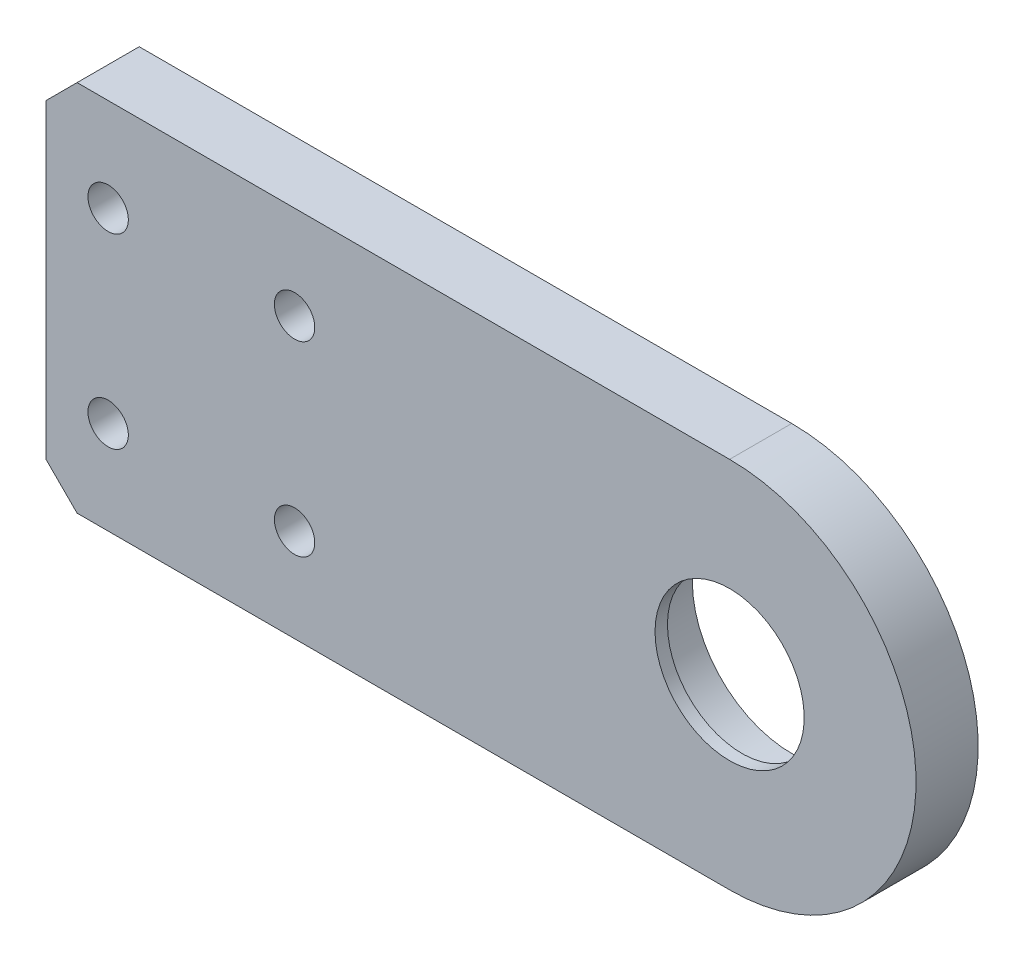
ISO-10303-21;
HEADER;
FILE_DESCRIPTION(('STEP AP214'),'2;1');
FILE_NAME('part.step','',(''),(''),'','','');
FILE_SCHEMA(('AUTOMOTIVE_DESIGN { 1 0 10303 214 1 1 1 1 }'));
ENDSEC;
DATA;
#1=APPLICATION_CONTEXT('core data for automotive mechanical design processes');
#2=APPLICATION_PROTOCOL_DEFINITION('international standard','automotive_design',2000,#1);
#3=PRODUCT_CONTEXT('',#1,'mechanical');
#4=PRODUCT('Part','Part','',(#3));
#5=PRODUCT_RELATED_PRODUCT_CATEGORY('part','',(#4));
#6=PRODUCT_DEFINITION_FORMATION('','',#4);
#7=PRODUCT_DEFINITION_CONTEXT('part definition',#1,'design');
#8=PRODUCT_DEFINITION('design','',#6,#7);
#9=PRODUCT_DEFINITION_SHAPE('','',#8);
#10=(LENGTH_UNIT() NAMED_UNIT(*) SI_UNIT(.MILLI.,.METRE.));
#11=(NAMED_UNIT(*) PLANE_ANGLE_UNIT() SI_UNIT($,.RADIAN.));
#12=(NAMED_UNIT(*) SI_UNIT($,.STERADIAN.) SOLID_ANGLE_UNIT());
#13=UNCERTAINTY_MEASURE_WITH_UNIT(LENGTH_MEASURE(1.E-05),#10,'distance_accuracy_value','');
#14=(GEOMETRIC_REPRESENTATION_CONTEXT(3) GLOBAL_UNCERTAINTY_ASSIGNED_CONTEXT((#13)) GLOBAL_UNIT_ASSIGNED_CONTEXT((#10,
#11,#12)) REPRESENTATION_CONTEXT('',''));
#15=CARTESIAN_POINT('',(0.,0.,0.));
#16=DIRECTION('',(0.,0.,1.));
#17=DIRECTION('',(1.,0.,0.));
#18=AXIS2_PLACEMENT_3D('',#15,#16,#17);
#19=CARTESIAN_POINT('',(40.,0.,8.));
#20=DIRECTION('',(0.,0.,-1.));
#21=DIRECTION('',(-1.,0.,0.));
#22=AXIS2_PLACEMENT_3D('',#19,#20,#21);
#23=CYLINDRICAL_SURFACE('',#22,16.);
#24=CARTESIAN_POINT('',(40.,0.,8.));
#25=DIRECTION('',(0.,0.,-1.));
#26=DIRECTION('',(-1.,0.,0.));
#27=AXIS2_PLACEMENT_3D('',#24,#25,#26);
#28=CIRCLE('',#27,16.);
#29=CARTESIAN_POINT('',(24.,0.,8.));
#30=VERTEX_POINT('',#29);
#31=EDGE_CURVE('E20',#30,#30,#28,.T.);
#32=ORIENTED_EDGE('',*,*,#31,.F.);
#33=EDGE_LOOP('',(#32));
#34=FACE_BOUND('',#33,.T.);
#35=CARTESIAN_POINT('',(40.,0.,0.));
#36=DIRECTION('',(0.,0.,-1.));
#37=DIRECTION('',(-1.,0.,0.));
#38=AXIS2_PLACEMENT_3D('',#35,#36,#37);
#39=CIRCLE('',#38,16.);
#40=CARTESIAN_POINT('',(24.,0.,0.));
#41=VERTEX_POINT('',#40);
#42=EDGE_CURVE('E167',#41,#41,#39,.T.);
#43=ORIENTED_EDGE('',*,*,#42,.T.);
#44=EDGE_LOOP('',(#43));
#45=FACE_BOUND('',#44,.T.);
#46=ADVANCED_FACE('F17',(#34,#45),#23,.F.);
#47=CARTESIAN_POINT('',(40.,0.,8.));
#48=DIRECTION('',(0.,0.,-1.));
#49=DIRECTION('',(-1.,0.,0.));
#50=AXIS2_PLACEMENT_3D('',#47,#48,#49);
#51=PLANE('',#50);
#52=CARTESIAN_POINT('',(40.,0.,8.));
#53=DIRECTION('',(0.,0.,-1.));
#54=DIRECTION('',(-1.,0.,0.));
#55=AXIS2_PLACEMENT_3D('',#52,#53,#54);
#56=CIRCLE('',#55,12.);
#57=CARTESIAN_POINT('',(28.,0.,8.));
#58=VERTEX_POINT('',#57);
#59=EDGE_CURVE('E131',#58,#58,#56,.F.);
#60=ORIENTED_EDGE('',*,*,#59,.T.);
#61=EDGE_LOOP('',(#60));
#62=FACE_BOUND('',#61,.T.);
#63=ORIENTED_EDGE('',*,*,#31,.T.);
#64=EDGE_LOOP('',(#63));
#65=FACE_BOUND('',#64,.T.);
#66=ADVANCED_FACE('F174',(#62,#65),#51,.T.);
#67=CARTESIAN_POINT('',(0.,0.,0.));
#68=DIRECTION('',(0.,0.,1.));
#69=DIRECTION('',(1.,0.,0.));
#70=AXIS2_PLACEMENT_3D('',#67,#68,#69);
#71=PLANE('',#70);
#72=DIRECTION('',(-0.707106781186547,0.707106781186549,0.));
#73=VECTOR('',#72,1.);
#74=CARTESIAN_POINT('',(-65.,-30.,0.));
#75=LINE('',#74,#73);
#76=CARTESIAN_POINT('',(-65.,-30.,0.));
#77=VERTEX_POINT('',#76);
#78=CARTESIAN_POINT('',(-70.,-24.9999999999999,0.));
#79=VERTEX_POINT('',#78);
#80=EDGE_CURVE('E108',#77,#79,#75,.T.);
#81=ORIENTED_EDGE('',*,*,#80,.T.);
#82=DIRECTION('',(0.,1.,0.));
#83=VECTOR('',#82,1.);
#84=CARTESIAN_POINT('',(-70.,30.,0.));
#85=LINE('',#84,#83);
#86=CARTESIAN_POINT('',(-70.,25.,0.));
#87=VERTEX_POINT('',#86);
#88=EDGE_CURVE('E129',#79,#87,#85,.T.);
#89=ORIENTED_EDGE('',*,*,#88,.T.);
#90=DIRECTION('',(0.707106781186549,0.707106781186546,0.));
#91=VECTOR('',#90,1.);
#92=CARTESIAN_POINT('',(-70.,25.,0.));
#93=LINE('',#92,#91);
#94=CARTESIAN_POINT('',(-65.,30.,0.));
#95=VERTEX_POINT('',#94);
#96=EDGE_CURVE('E119',#87,#95,#93,.T.);
#97=ORIENTED_EDGE('',*,*,#96,.T.);
#98=DIRECTION('',(1.,0.,0.));
#99=VECTOR('',#98,1.);
#100=CARTESIAN_POINT('',(-70.,30.,0.));
#101=LINE('',#100,#99);
#102=CARTESIAN_POINT('',(40.,30.,0.));
#103=VERTEX_POINT('',#102);
#104=EDGE_CURVE('E67',#95,#103,#101,.T.);
#105=ORIENTED_EDGE('',*,*,#104,.T.);
#106=CARTESIAN_POINT('',(40.,0.,0.));
#107=DIRECTION('',(0.,0.,-1.));
#108=DIRECTION('',(-1.,0.,0.));
#109=AXIS2_PLACEMENT_3D('',#106,#107,#108);
#110=CIRCLE('',#109,30.);
#111=CARTESIAN_POINT('',(40.,-30.,0.));
#112=VERTEX_POINT('',#111);
#113=EDGE_CURVE('E70',#112,#103,#110,.F.);
#114=ORIENTED_EDGE('',*,*,#113,.F.);
#115=DIRECTION('',(1.,0.,0.));
#116=VECTOR('',#115,1.);
#117=CARTESIAN_POINT('',(-70.,-30.,0.));
#118=LINE('',#117,#116);
#119=EDGE_CURVE('E74',#112,#77,#118,.F.);
#120=ORIENTED_EDGE('',*,*,#119,.T.);
#121=EDGE_LOOP('',(#81,#89,#97,#105,#114,#120));
#122=FACE_BOUND('',#121,.T.);
#123=CARTESIAN_POINT('',(-60.,15.,0.));
#124=DIRECTION('',(0.,0.,-1.));
#125=DIRECTION('',(-1.,0.,0.));
#126=AXIS2_PLACEMENT_3D('',#123,#124,#125);
#127=CIRCLE('',#126,3.25000000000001);
#128=CARTESIAN_POINT('',(-63.25,15.,0.));
#129=VERTEX_POINT('',#128);
#130=EDGE_CURVE('E156',#129,#129,#127,.F.);
#131=ORIENTED_EDGE('',*,*,#130,.T.);
#132=EDGE_LOOP('',(#131));
#133=FACE_BOUND('',#132,.T.);
#134=CARTESIAN_POINT('',(-60.,-15.,0.));
#135=DIRECTION('',(0.,0.,-1.));
#136=DIRECTION('',(-1.,0.,0.));
#137=AXIS2_PLACEMENT_3D('',#134,#135,#136);
#138=CIRCLE('',#137,3.25000000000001);
#139=CARTESIAN_POINT('',(-63.25,-15.,0.));
#140=VERTEX_POINT('',#139);
#141=EDGE_CURVE('E159',#140,#140,#138,.F.);
#142=ORIENTED_EDGE('',*,*,#141,.T.);
#143=EDGE_LOOP('',(#142));
#144=FACE_BOUND('',#143,.T.);
#145=CARTESIAN_POINT('',(-30.,15.,0.));
#146=DIRECTION('',(0.,0.,-1.));
#147=DIRECTION('',(-1.,0.,0.));
#148=AXIS2_PLACEMENT_3D('',#145,#146,#147);
#149=CIRCLE('',#148,3.25);
#150=CARTESIAN_POINT('',(-33.25,15.,0.));
#151=VERTEX_POINT('',#150);
#152=EDGE_CURVE('E162',#151,#151,#149,.F.);
#153=ORIENTED_EDGE('',*,*,#152,.T.);
#154=EDGE_LOOP('',(#153));
#155=FACE_BOUND('',#154,.T.);
#156=CARTESIAN_POINT('',(-30.,-15.,0.));
#157=DIRECTION('',(0.,0.,-1.));
#158=DIRECTION('',(-1.,0.,0.));
#159=AXIS2_PLACEMENT_3D('',#156,#157,#158);
#160=CIRCLE('',#159,3.25);
#161=CARTESIAN_POINT('',(-33.25,-15.,0.));
#162=VERTEX_POINT('',#161);
#163=EDGE_CURVE('E165',#162,#162,#160,.F.);
#164=ORIENTED_EDGE('',*,*,#163,.T.);
#165=EDGE_LOOP('',(#164));
#166=FACE_BOUND('',#165,.T.);
#167=ORIENTED_EDGE('',*,*,#42,.F.);
#168=EDGE_LOOP('',(#167));
#169=FACE_BOUND('',#168,.T.);
#170=ADVANCED_FACE('F72',(#122,#133,#144,#155,#166,#169),#71,.F.);
#171=CARTESIAN_POINT('',(-30.,-15.,10.));
#172=DIRECTION('',(0.,0.,-1.));
#173=DIRECTION('',(-1.,0.,0.));
#174=AXIS2_PLACEMENT_3D('',#171,#172,#173);
#175=CYLINDRICAL_SURFACE('',#174,3.25);
#176=ORIENTED_EDGE('',*,*,#163,.F.);
#177=EDGE_LOOP('',(#176));
#178=FACE_BOUND('',#177,.T.);
#179=CARTESIAN_POINT('',(-30.,-15.,10.));
#180=DIRECTION('',(0.,0.,-1.));
#181=DIRECTION('',(-1.,0.,0.));
#182=AXIS2_PLACEMENT_3D('',#179,#180,#181);
#183=CIRCLE('',#182,3.25);
#184=CARTESIAN_POINT('',(-33.25,-15.,10.));
#185=VERTEX_POINT('',#184);
#186=EDGE_CURVE('E151',#185,#185,#183,.T.);
#187=ORIENTED_EDGE('',*,*,#186,.F.);
#188=EDGE_LOOP('',(#187));
#189=FACE_BOUND('',#188,.T.);
#190=ADVANCED_FACE('F225',(#178,#189),#175,.F.);
#191=CARTESIAN_POINT('',(-30.,15.,10.));
#192=DIRECTION('',(0.,0.,-1.));
#193=DIRECTION('',(-1.,0.,0.));
#194=AXIS2_PLACEMENT_3D('',#191,#192,#193);
#195=CYLINDRICAL_SURFACE('',#194,3.25);
#196=ORIENTED_EDGE('',*,*,#152,.F.);
#197=EDGE_LOOP('',(#196));
#198=FACE_BOUND('',#197,.T.);
#199=CARTESIAN_POINT('',(-30.,15.,10.));
#200=DIRECTION('',(0.,0.,-1.));
#201=DIRECTION('',(-1.,0.,0.));
#202=AXIS2_PLACEMENT_3D('',#199,#200,#201);
#203=CIRCLE('',#202,3.25);
#204=CARTESIAN_POINT('',(-33.25,15.,10.));
#205=VERTEX_POINT('',#204);
#206=EDGE_CURVE('E148',#205,#205,#203,.T.);
#207=ORIENTED_EDGE('',*,*,#206,.F.);
#208=EDGE_LOOP('',(#207));
#209=FACE_BOUND('',#208,.T.);
#210=ADVANCED_FACE('F221',(#198,#209),#195,.F.);
#211=CARTESIAN_POINT('',(-60.,-15.,10.));
#212=DIRECTION('',(0.,0.,-1.));
#213=DIRECTION('',(-1.,0.,0.));
#214=AXIS2_PLACEMENT_3D('',#211,#212,#213);
#215=CYLINDRICAL_SURFACE('',#214,3.25000000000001);
#216=ORIENTED_EDGE('',*,*,#141,.F.);
#217=EDGE_LOOP('',(#216));
#218=FACE_BOUND('',#217,.T.);
#219=CARTESIAN_POINT('',(-60.,-15.,10.));
#220=DIRECTION('',(0.,0.,-1.));
#221=DIRECTION('',(-1.,0.,0.));
#222=AXIS2_PLACEMENT_3D('',#219,#220,#221);
#223=CIRCLE('',#222,3.25000000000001);
#224=CARTESIAN_POINT('',(-63.25,-15.,10.));
#225=VERTEX_POINT('',#224);
#226=EDGE_CURVE('E145',#225,#225,#223,.T.);
#227=ORIENTED_EDGE('',*,*,#226,.F.);
#228=EDGE_LOOP('',(#227));
#229=FACE_BOUND('',#228,.T.);
#230=ADVANCED_FACE('F217',(#218,#229),#215,.F.);
#231=CARTESIAN_POINT('',(-60.,15.,10.));
#232=DIRECTION('',(0.,0.,-1.));
#233=DIRECTION('',(-1.,0.,0.));
#234=AXIS2_PLACEMENT_3D('',#231,#232,#233);
#235=CYLINDRICAL_SURFACE('',#234,3.25000000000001);
#236=ORIENTED_EDGE('',*,*,#130,.F.);
#237=EDGE_LOOP('',(#236));
#238=FACE_BOUND('',#237,.T.);
#239=CARTESIAN_POINT('',(-60.,15.,10.));
#240=DIRECTION('',(0.,0.,-1.));
#241=DIRECTION('',(-1.,0.,0.));
#242=AXIS2_PLACEMENT_3D('',#239,#240,#241);
#243=CIRCLE('',#242,3.25000000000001);
#244=CARTESIAN_POINT('',(-63.25,15.,10.));
#245=VERTEX_POINT('',#244);
#246=EDGE_CURVE('E142',#245,#245,#243,.T.);
#247=ORIENTED_EDGE('',*,*,#246,.F.);
#248=EDGE_LOOP('',(#247));
#249=FACE_BOUND('',#248,.T.);
#250=ADVANCED_FACE('F213',(#238,#249),#235,.F.);
#251=CARTESIAN_POINT('',(40.,0.,10.));
#252=DIRECTION('',(0.,0.,-1.));
#253=DIRECTION('',(-1.,0.,0.));
#254=AXIS2_PLACEMENT_3D('',#251,#252,#253);
#255=CYLINDRICAL_SURFACE('',#254,12.);
#256=ORIENTED_EDGE('',*,*,#59,.F.);
#257=EDGE_LOOP('',(#256));
#258=FACE_BOUND('',#257,.T.);
#259=CARTESIAN_POINT('',(40.,0.,10.));
#260=DIRECTION('',(0.,0.,-1.));
#261=DIRECTION('',(-1.,0.,0.));
#262=AXIS2_PLACEMENT_3D('',#259,#260,#261);
#263=CIRCLE('',#262,12.);
#264=CARTESIAN_POINT('',(28.,0.,10.));
#265=VERTEX_POINT('',#264);
#266=EDGE_CURVE('E113',#265,#265,#263,.T.);
#267=ORIENTED_EDGE('',*,*,#266,.F.);
#268=EDGE_LOOP('',(#267));
#269=FACE_BOUND('',#268,.T.);
#270=ADVANCED_FACE('F209',(#258,#269),#255,.F.);
#271=CARTESIAN_POINT('',(-70.,30.,10.));
#272=DIRECTION('',(1.,0.,0.));
#273=DIRECTION('',(0.,1.,0.));
#274=AXIS2_PLACEMENT_3D('',#271,#272,#273);
#275=PLANE('',#274);
#276=DIRECTION('',(0.,0.,1.));
#277=VECTOR('',#276,1.);
#278=CARTESIAN_POINT('',(-70.,-25.,10.));
#279=LINE('',#278,#277);
#280=CARTESIAN_POINT('',(-70.,-24.9999999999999,10.));
#281=VERTEX_POINT('',#280);
#282=EDGE_CURVE('E97',#79,#281,#279,.T.);
#283=ORIENTED_EDGE('',*,*,#282,.T.);
#284=DIRECTION('',(0.,1.,0.));
#285=VECTOR('',#284,1.);
#286=CARTESIAN_POINT('',(-70.,0.,10.));
#287=LINE('',#286,#285);
#288=CARTESIAN_POINT('',(-70.,25.,10.));
#289=VERTEX_POINT('',#288);
#290=EDGE_CURVE('E104',#289,#281,#287,.F.);
#291=ORIENTED_EDGE('',*,*,#290,.F.);
#292=DIRECTION('',(0.,0.,1.));
#293=VECTOR('',#292,1.);
#294=CARTESIAN_POINT('',(-70.,25.,10.));
#295=LINE('',#294,#293);
#296=EDGE_CURVE('E116',#289,#87,#295,.F.);
#297=ORIENTED_EDGE('',*,*,#296,.T.);
#298=ORIENTED_EDGE('',*,*,#88,.F.);
#299=EDGE_LOOP('',(#283,#291,#297,#298));
#300=FACE_BOUND('',#299,.T.);
#301=ADVANCED_FACE('F205',(#300),#275,.F.);
#302=CARTESIAN_POINT('',(-65.,-30.,10.));
#303=DIRECTION('',(0.707106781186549,0.707106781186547,0.));
#304=DIRECTION('',(-0.707106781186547,0.707106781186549,0.));
#305=AXIS2_PLACEMENT_3D('',#302,#303,#304);
#306=PLANE('',#305);
#307=ORIENTED_EDGE('',*,*,#282,.F.);
#308=ORIENTED_EDGE('',*,*,#80,.F.);
#309=DIRECTION('',(0.,0.,1.));
#310=VECTOR('',#309,1.);
#311=CARTESIAN_POINT('',(-65.,-30.,10.));
#312=LINE('',#311,#310);
#313=CARTESIAN_POINT('',(-65.,-30.,10.));
#314=VERTEX_POINT('',#313);
#315=EDGE_CURVE('E86',#77,#314,#312,.T.);
#316=ORIENTED_EDGE('',*,*,#315,.T.);
#317=DIRECTION('',(0.707106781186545,-0.70710678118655,0.));
#318=VECTOR('',#317,1.);
#319=CARTESIAN_POINT('',(-70.,-24.9999999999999,10.));
#320=LINE('',#319,#318);
#321=EDGE_CURVE('E100',#281,#314,#320,.T.);
#322=ORIENTED_EDGE('',*,*,#321,.F.);
#323=EDGE_LOOP('',(#307,#308,#316,#322));
#324=FACE_BOUND('',#323,.T.);
#325=ADVANCED_FACE('F202',(#324),#306,.F.);
#326=CARTESIAN_POINT('',(-70.,-30.,10.));
#327=DIRECTION('',(0.,1.,0.));
#328=DIRECTION('',(0.,0.,1.));
#329=AXIS2_PLACEMENT_3D('',#326,#327,#328);
#330=PLANE('',#329);
#331=DIRECTION('',(0.,0.,-1.));
#332=VECTOR('',#331,1.);
#333=CARTESIAN_POINT('',(40.,-30.,10.));
#334=LINE('',#333,#332);
#335=CARTESIAN_POINT('',(40.,-30.,10.));
#336=VERTEX_POINT('',#335);
#337=EDGE_CURVE('E80',#336,#112,#334,.T.);
#338=ORIENTED_EDGE('',*,*,#337,.F.);
#339=DIRECTION('',(1.,0.,0.));
#340=VECTOR('',#339,1.);
#341=CARTESIAN_POINT('',(0.,-30.,10.));
#342=LINE('',#341,#340);
#343=EDGE_CURVE('E103',#314,#336,#342,.T.);
#344=ORIENTED_EDGE('',*,*,#343,.F.);
#345=ORIENTED_EDGE('',*,*,#315,.F.);
#346=ORIENTED_EDGE('',*,*,#119,.F.);
#347=EDGE_LOOP('',(#338,#344,#345,#346));
#348=FACE_BOUND('',#347,.T.);
#349=ADVANCED_FACE('F83',(#348),#330,.F.);
#350=CARTESIAN_POINT('',(40.,0.,10.));
#351=DIRECTION('',(0.,0.,-1.));
#352=DIRECTION('',(-1.,0.,0.));
#353=AXIS2_PLACEMENT_3D('',#350,#351,#352);
#354=CYLINDRICAL_SURFACE('',#353,30.);
#355=DIRECTION('',(0.,0.,-1.));
#356=VECTOR('',#355,1.);
#357=CARTESIAN_POINT('',(40.,30.,10.));
#358=LINE('',#357,#356);
#359=CARTESIAN_POINT('',(40.,30.,10.));
#360=VERTEX_POINT('',#359);
#361=EDGE_CURVE('E120',#103,#360,#358,.F.);
#362=ORIENTED_EDGE('',*,*,#361,.T.);
#363=CARTESIAN_POINT('',(40.,0.,10.));
#364=DIRECTION('',(0.,0.,-1.));
#365=DIRECTION('',(-1.,0.,0.));
#366=AXIS2_PLACEMENT_3D('',#363,#364,#365);
#367=CIRCLE('',#366,30.);
#368=EDGE_CURVE('E89',#336,#360,#367,.F.);
#369=ORIENTED_EDGE('',*,*,#368,.F.);
#370=ORIENTED_EDGE('',*,*,#337,.T.);
#371=ORIENTED_EDGE('',*,*,#113,.T.);
#372=EDGE_LOOP('',(#362,#369,#370,#371));
#373=FACE_BOUND('',#372,.T.);
#374=ADVANCED_FACE('F88',(#373),#354,.T.);
#375=CARTESIAN_POINT('',(-70.,30.,10.));
#376=DIRECTION('',(0.,-1.,0.));
#377=DIRECTION('',(0.,0.,-1.));
#378=AXIS2_PLACEMENT_3D('',#375,#376,#377);
#379=PLANE('',#378);
#380=ORIENTED_EDGE('',*,*,#104,.F.);
#381=DIRECTION('',(0.,0.,1.));
#382=VECTOR('',#381,1.);
#383=CARTESIAN_POINT('',(-65.,30.,10.));
#384=LINE('',#383,#382);
#385=CARTESIAN_POINT('',(-65.,30.,10.));
#386=VERTEX_POINT('',#385);
#387=EDGE_CURVE('E35',#95,#386,#384,.T.);
#388=ORIENTED_EDGE('',*,*,#387,.T.);
#389=DIRECTION('',(1.,0.,0.));
#390=VECTOR('',#389,1.);
#391=CARTESIAN_POINT('',(0.,30.,10.));
#392=LINE('',#391,#390);
#393=EDGE_CURVE('E26',#360,#386,#392,.F.);
#394=ORIENTED_EDGE('',*,*,#393,.F.);
#395=ORIENTED_EDGE('',*,*,#361,.F.);
#396=EDGE_LOOP('',(#380,#388,#394,#395));
#397=FACE_BOUND('',#396,.T.);
#398=ADVANCED_FACE('F190',(#397),#379,.F.);
#399=CARTESIAN_POINT('',(-70.,25.,10.));
#400=DIRECTION('',(0.707106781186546,-0.707106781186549,0.));
#401=DIRECTION('',(0.707106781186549,0.707106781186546,0.));
#402=AXIS2_PLACEMENT_3D('',#399,#400,#401);
#403=PLANE('',#402);
#404=ORIENTED_EDGE('',*,*,#387,.F.);
#405=ORIENTED_EDGE('',*,*,#96,.F.);
#406=ORIENTED_EDGE('',*,*,#296,.F.);
#407=DIRECTION('',(-0.707106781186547,-0.707106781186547,0.));
#408=VECTOR('',#407,1.);
#409=CARTESIAN_POINT('',(-65.,30.,10.));
#410=LINE('',#409,#408);
#411=EDGE_CURVE('E11',#386,#289,#410,.T.);
#412=ORIENTED_EDGE('',*,*,#411,.F.);
#413=EDGE_LOOP('',(#404,#405,#406,#412));
#414=FACE_BOUND('',#413,.T.);
#415=ADVANCED_FACE('F184',(#414),#403,.F.);
#416=CARTESIAN_POINT('',(0.,0.,10.));
#417=DIRECTION('',(0.,0.,1.));
#418=DIRECTION('',(1.,0.,0.));
#419=AXIS2_PLACEMENT_3D('',#416,#417,#418);
#420=PLANE('',#419);
#421=ORIENTED_EDGE('',*,*,#393,.T.);
#422=ORIENTED_EDGE('',*,*,#411,.T.);
#423=ORIENTED_EDGE('',*,*,#290,.T.);
#424=ORIENTED_EDGE('',*,*,#321,.T.);
#425=ORIENTED_EDGE('',*,*,#343,.T.);
#426=ORIENTED_EDGE('',*,*,#368,.T.);
#427=EDGE_LOOP('',(#421,#422,#423,#424,#425,#426));
#428=FACE_BOUND('',#427,.T.);
#429=ORIENTED_EDGE('',*,*,#266,.T.);
#430=EDGE_LOOP('',(#429));
#431=FACE_BOUND('',#430,.T.);
#432=ORIENTED_EDGE('',*,*,#246,.T.);
#433=EDGE_LOOP('',(#432));
#434=FACE_BOUND('',#433,.T.);
#435=ORIENTED_EDGE('',*,*,#226,.T.);
#436=EDGE_LOOP('',(#435));
#437=FACE_BOUND('',#436,.T.);
#438=ORIENTED_EDGE('',*,*,#206,.T.);
#439=EDGE_LOOP('',(#438));
#440=FACE_BOUND('',#439,.T.);
#441=ORIENTED_EDGE('',*,*,#186,.T.);
#442=EDGE_LOOP('',(#441));
#443=FACE_BOUND('',#442,.T.);
#444=ADVANCED_FACE('F182',(#428,#431,#434,#437,#440,#443),#420,.T.);
#445=CLOSED_SHELL('',(#46,#66,#170,#190,#210,#230,#250,#270,#301,#325,#349,#374,#398,#415,#444));
#446=MANIFOLD_SOLID_BREP('B1',#445);
#447=ADVANCED_BREP_SHAPE_REPRESENTATION('',(#18,#446),#14);
#448=SHAPE_DEFINITION_REPRESENTATION(#9,#447);
ENDSEC;
END-ISO-10303-21;
